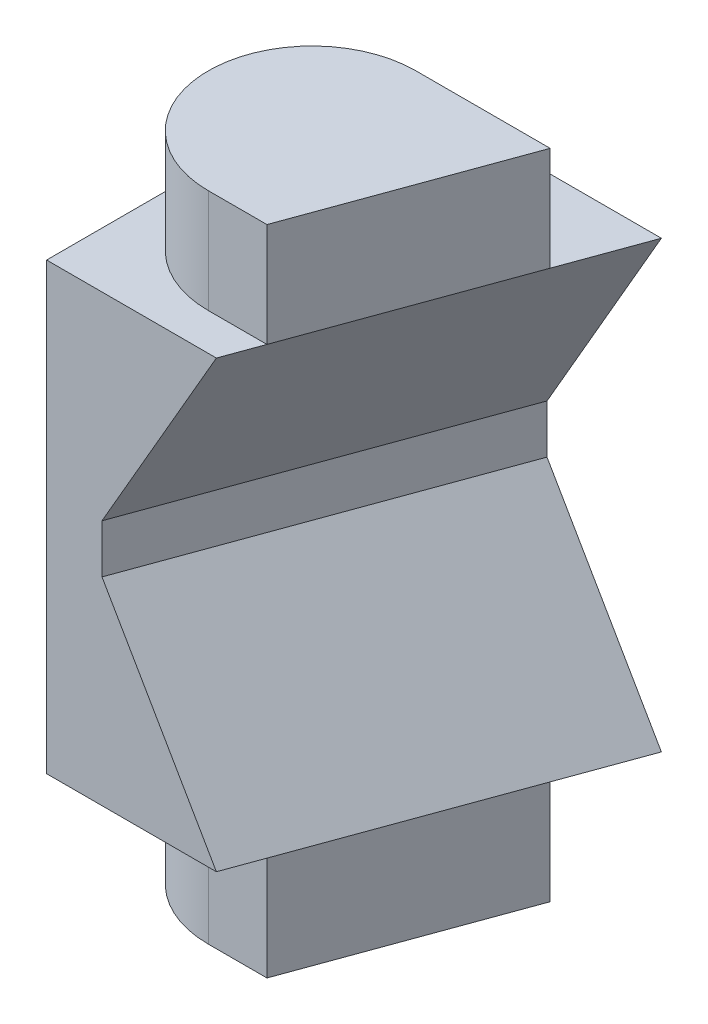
ISO-10303-21;
HEADER;
FILE_DESCRIPTION(('STEP AP214'),'2;1');
FILE_NAME('part.step','',(''),(''),'','','');
FILE_SCHEMA(('AUTOMOTIVE_DESIGN { 1 0 10303 214 1 1 1 1 }'));
ENDSEC;
DATA;
#1=APPLICATION_CONTEXT('core data for automotive mechanical design processes');
#2=APPLICATION_PROTOCOL_DEFINITION('international standard','automotive_design',2000,#1);
#3=PRODUCT_CONTEXT('',#1,'mechanical');
#4=PRODUCT('Part','Part','',(#3));
#5=PRODUCT_RELATED_PRODUCT_CATEGORY('part','',(#4));
#6=PRODUCT_DEFINITION_FORMATION('','',#4);
#7=PRODUCT_DEFINITION_CONTEXT('part definition',#1,'design');
#8=PRODUCT_DEFINITION('design','',#6,#7);
#9=PRODUCT_DEFINITION_SHAPE('','',#8);
#10=(LENGTH_UNIT() NAMED_UNIT(*) SI_UNIT(.MILLI.,.METRE.));
#11=(NAMED_UNIT(*) PLANE_ANGLE_UNIT() SI_UNIT($,.RADIAN.));
#12=(NAMED_UNIT(*) SI_UNIT($,.STERADIAN.) SOLID_ANGLE_UNIT());
#13=UNCERTAINTY_MEASURE_WITH_UNIT(LENGTH_MEASURE(1.E-05),#10,'distance_accuracy_value','');
#14=(GEOMETRIC_REPRESENTATION_CONTEXT(3) GLOBAL_UNCERTAINTY_ASSIGNED_CONTEXT((#13)) GLOBAL_UNIT_ASSIGNED_CONTEXT((#10,
#11,#12)) REPRESENTATION_CONTEXT('',''));
#15=CARTESIAN_POINT('',(0.,0.,0.));
#16=DIRECTION('',(0.,0.,1.));
#17=DIRECTION('',(1.,0.,0.));
#18=AXIS2_PLACEMENT_3D('',#15,#16,#17);
#19=CARTESIAN_POINT('',(-3.20366448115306,7.5,18.7435854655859));
#20=DIRECTION('',(0.,1.,0.));
#21=DIRECTION('',(0.,0.,1.));
#22=AXIS2_PLACEMENT_3D('',#19,#20,#21);
#23=PLANE('',#22);
#24=DIRECTION('',(0.342020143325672,0.,-0.939692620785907));
#25=VECTOR('',#24,1.);
#26=CARTESIAN_POINT('',(19.5018139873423,7.5,-26.8546995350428));
#27=LINE('',#26,#25);
#28=CARTESIAN_POINT('',(5.72383012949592,7.5,11.));
#29=VERTEX_POINT('',#28);
#30=CARTESIAN_POINT('',(6.17879292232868,7.5,9.75));
#31=VERTEX_POINT('',#30);
#32=EDGE_CURVE('E200',#29,#31,#27,.T.);
#33=ORIENTED_EDGE('',*,*,#32,.T.);
#34=DIRECTION('',(-1.,0.,0.));
#35=VECTOR('',#34,1.);
#36=CARTESIAN_POINT('',(4.2,7.5,9.75));
#37=LINE('',#36,#35);
#38=CARTESIAN_POINT('',(4.2,7.5,9.75));
#39=VERTEX_POINT('',#38);
#40=EDGE_CURVE('E136',#31,#39,#37,.T.);
#41=ORIENTED_EDGE('',*,*,#40,.T.);
#42=CARTESIAN_POINT('',(4.2,7.5,6.25));
#43=DIRECTION('',(0.,-1.,0.));
#44=DIRECTION('',(0.,0.,-1.));
#45=AXIS2_PLACEMENT_3D('',#42,#43,#44);
#46=CIRCLE('',#45,3.5);
#47=CARTESIAN_POINT('',(4.2,7.5,2.75));
#48=VERTEX_POINT('',#47);
#49=EDGE_CURVE('E147',#39,#48,#46,.T.);
#50=ORIENTED_EDGE('',*,*,#49,.T.);
#51=DIRECTION('',(1.,0.,0.));
#52=VECTOR('',#51,1.);
#53=CARTESIAN_POINT('',(4.2,7.5,2.75));
#54=LINE('',#53,#52);
#55=CARTESIAN_POINT('',(8.7265845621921,7.5,2.75));
#56=VERTEX_POINT('',#55);
#57=EDGE_CURVE('E150',#48,#56,#54,.T.);
#58=ORIENTED_EDGE('',*,*,#57,.T.);
#59=CARTESIAN_POINT('',(9.7275027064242,7.5,0.));
#60=VERTEX_POINT('',#59);
#61=EDGE_CURVE('E153',#56,#60,#27,.T.);
#62=ORIENTED_EDGE('',*,*,#61,.T.);
#63=DIRECTION('',(1.,0.,0.));
#64=VECTOR('',#63,1.);
#65=CARTESIAN_POINT('',(-2.,7.5,0.));
#66=LINE('',#65,#64);
#67=CARTESIAN_POINT('',(0.,7.5,0.));
#68=VERTEX_POINT('',#67);
#69=EDGE_CURVE('E201',#68,#60,#66,.T.);
#70=ORIENTED_EDGE('',*,*,#69,.F.);
#71=DIRECTION('',(0.,0.,-1.));
#72=VECTOR('',#71,1.);
#73=CARTESIAN_POINT('',(0.,7.5,11.));
#74=LINE('',#73,#72);
#75=CARTESIAN_POINT('',(0.,7.5,11.));
#76=VERTEX_POINT('',#75);
#77=EDGE_CURVE('E297',#76,#68,#74,.T.);
#78=ORIENTED_EDGE('',*,*,#77,.F.);
#79=DIRECTION('',(-1.,0.,0.));
#80=VECTOR('',#79,1.);
#81=CARTESIAN_POINT('',(-3.03469760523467,7.5,11.));
#82=LINE('',#81,#80);
#83=EDGE_CURVE('E9',#29,#76,#82,.T.);
#84=ORIENTED_EDGE('',*,*,#83,.F.);
#85=EDGE_LOOP('',(#33,#41,#50,#58,#62,#70,#78,#84));
#86=FACE_BOUND('',#85,.T.);
#87=ADVANCED_FACE('F14',(#86),#23,.T.);
#88=CARTESIAN_POINT('',(-4.9156779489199,-7.5,16.4707275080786));
#89=DIRECTION('',(0.,1.,0.));
#90=DIRECTION('',(0.,0.,1.));
#91=AXIS2_PLACEMENT_3D('',#88,#89,#90);
#92=PLANE('',#91);
#93=DIRECTION('',(1.,0.,0.));
#94=VECTOR('',#93,1.);
#95=CARTESIAN_POINT('',(4.2,-7.5,2.75));
#96=LINE('',#95,#94);
#97=CARTESIAN_POINT('',(4.2,-7.5,2.75));
#98=VERTEX_POINT('',#97);
#99=CARTESIAN_POINT('',(8.7265845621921,-7.5,2.75));
#100=VERTEX_POINT('',#99);
#101=EDGE_CURVE('E39',#98,#100,#96,.T.);
#102=ORIENTED_EDGE('',*,*,#101,.F.);
#103=CARTESIAN_POINT('',(4.2,-7.5,6.25));
#104=DIRECTION('',(0.,-1.,0.));
#105=DIRECTION('',(0.,0.,-1.));
#106=AXIS2_PLACEMENT_3D('',#103,#104,#105);
#107=CIRCLE('',#106,3.5);
#108=CARTESIAN_POINT('',(4.2,-7.5,9.75));
#109=VERTEX_POINT('',#108);
#110=EDGE_CURVE('E185',#109,#98,#107,.T.);
#111=ORIENTED_EDGE('',*,*,#110,.F.);
#112=DIRECTION('',(-1.,0.,0.));
#113=VECTOR('',#112,1.);
#114=CARTESIAN_POINT('',(4.2,-7.5,9.75));
#115=LINE('',#114,#113);
#116=CARTESIAN_POINT('',(6.17879292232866,-7.5,9.75));
#117=VERTEX_POINT('',#116);
#118=EDGE_CURVE('E187',#117,#109,#115,.T.);
#119=ORIENTED_EDGE('',*,*,#118,.F.);
#120=DIRECTION('',(-0.342020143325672,0.,0.939692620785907));
#121=VECTOR('',#120,1.);
#122=CARTESIAN_POINT('',(19.5018139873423,-7.5,-26.8546995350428));
#123=LINE('',#122,#121);
#124=CARTESIAN_POINT('',(5.72383012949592,-7.5,11.));
#125=VERTEX_POINT('',#124);
#126=EDGE_CURVE('E210',#117,#125,#123,.T.);
#127=ORIENTED_EDGE('',*,*,#126,.T.);
#128=DIRECTION('',(-1.,0.,0.));
#129=VECTOR('',#128,1.);
#130=CARTESIAN_POINT('',(-3.03469760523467,-7.5,11.));
#131=LINE('',#130,#129);
#132=CARTESIAN_POINT('',(0.,-7.5,11.));
#133=VERTEX_POINT('',#132);
#134=EDGE_CURVE('E23',#125,#133,#131,.T.);
#135=ORIENTED_EDGE('',*,*,#134,.T.);
#136=DIRECTION('',(0.,0.,1.));
#137=VECTOR('',#136,1.);
#138=CARTESIAN_POINT('',(0.,-7.5,0.));
#139=LINE('',#138,#137);
#140=CARTESIAN_POINT('',(0.,-7.5,0.));
#141=VERTEX_POINT('',#140);
#142=EDGE_CURVE('E249',#141,#133,#139,.T.);
#143=ORIENTED_EDGE('',*,*,#142,.F.);
#144=DIRECTION('',(1.,0.,0.));
#145=VECTOR('',#144,1.);
#146=CARTESIAN_POINT('',(-2.,-7.5,0.));
#147=LINE('',#146,#145);
#148=CARTESIAN_POINT('',(9.7275027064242,-7.5,0.));
#149=VERTEX_POINT('',#148);
#150=EDGE_CURVE('E213',#141,#149,#147,.T.);
#151=ORIENTED_EDGE('',*,*,#150,.T.);
#152=EDGE_CURVE('E219',#149,#100,#123,.T.);
#153=ORIENTED_EDGE('',*,*,#152,.T.);
#154=EDGE_LOOP('',(#102,#111,#119,#127,#135,#143,#151,#153));
#155=FACE_BOUND('',#154,.T.);
#156=ADVANCED_FACE('F248',(#155),#92,.F.);
#157=CARTESIAN_POINT('',(-2.,10.5,0.));
#158=DIRECTION('',(0.,0.,-1.));
#159=DIRECTION('',(-1.,0.,0.));
#160=AXIS2_PLACEMENT_3D('',#157,#158,#159);
#161=PLANE('',#160);
#162=ORIENTED_EDGE('',*,*,#150,.F.);
#163=DIRECTION('',(0.,-1.,0.));
#164=VECTOR('',#163,1.);
#165=CARTESIAN_POINT('',(0.,7.5,0.));
#166=LINE('',#165,#164);
#167=EDGE_CURVE('E205',#68,#141,#166,.T.);
#168=ORIENTED_EDGE('',*,*,#167,.F.);
#169=ORIENTED_EDGE('',*,*,#69,.T.);
#170=DIRECTION('',(-0.5,-0.866025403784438,0.));
#171=VECTOR('',#170,1.);
#172=CARTESIAN_POINT('',(13.8524784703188,14.6446676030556,0.));
#173=LINE('',#172,#171);
#174=CARTESIAN_POINT('',(5.87080290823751,0.82,0.));
#175=VERTEX_POINT('',#174);
#176=EDGE_CURVE('E230',#60,#175,#173,.T.);
#177=ORIENTED_EDGE('',*,*,#176,.T.);
#178=DIRECTION('',(0.,1.,0.));
#179=VECTOR('',#178,1.);
#180=CARTESIAN_POINT('',(5.87080290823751,-0.82,0.));
#181=LINE('',#180,#179);
#182=CARTESIAN_POINT('',(5.87080290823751,-0.82,0.));
#183=VERTEX_POINT('',#182);
#184=EDGE_CURVE('E236',#183,#175,#181,.T.);
#185=ORIENTED_EDGE('',*,*,#184,.F.);
#186=DIRECTION('',(-0.5,0.866025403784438,0.));
#187=VECTOR('',#186,1.);
#188=CARTESIAN_POINT('',(13.8524784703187,-14.6446676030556,0.));
#189=LINE('',#188,#187);
#190=EDGE_CURVE('E226',#149,#183,#189,.T.);
#191=ORIENTED_EDGE('',*,*,#190,.F.);
#192=EDGE_LOOP('',(#162,#168,#169,#177,#185,#191));
#193=FACE_BOUND('',#192,.T.);
#194=ADVANCED_FACE('F16',(#193),#161,.T.);
#195=CARTESIAN_POINT('',(-3.03469760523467,-15.2330023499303,11.));
#196=DIRECTION('',(0.,0.,1.));
#197=DIRECTION('',(1.,0.,0.));
#198=AXIS2_PLACEMENT_3D('',#195,#196,#197);
#199=PLANE('',#198);
#200=ORIENTED_EDGE('',*,*,#83,.T.);
#201=DIRECTION('',(0.,1.,0.));
#202=VECTOR('',#201,1.);
#203=CARTESIAN_POINT('',(0.,-7.5,11.));
#204=LINE('',#203,#202);
#205=EDGE_CURVE('E296',#133,#76,#204,.T.);
#206=ORIENTED_EDGE('',*,*,#205,.F.);
#207=ORIENTED_EDGE('',*,*,#134,.F.);
#208=DIRECTION('',(0.5,-0.866025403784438,0.));
#209=VECTOR('',#208,1.);
#210=CARTESIAN_POINT('',(10.8497240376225,-16.3783086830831,11.));
#211=LINE('',#210,#209);
#212=CARTESIAN_POINT('',(1.86713033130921,-0.82,11.));
#213=VERTEX_POINT('',#212);
#214=EDGE_CURVE('E234',#213,#125,#211,.T.);
#215=ORIENTED_EDGE('',*,*,#214,.F.);
#216=DIRECTION('',(0.,-1.,0.));
#217=VECTOR('',#216,1.);
#218=CARTESIAN_POINT('',(1.86713033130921,-0.82,11.));
#219=LINE('',#218,#217);
#220=CARTESIAN_POINT('',(1.86713033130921,0.82,11.));
#221=VERTEX_POINT('',#220);
#222=EDGE_CURVE('E241',#221,#213,#219,.T.);
#223=ORIENTED_EDGE('',*,*,#222,.F.);
#224=DIRECTION('',(0.5,0.866025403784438,0.));
#225=VECTOR('',#224,1.);
#226=CARTESIAN_POINT('',(10.8497240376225,16.3783086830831,11.));
#227=LINE('',#226,#225);
#228=EDGE_CURVE('E223',#221,#29,#227,.T.);
#229=ORIENTED_EDGE('',*,*,#228,.T.);
#230=EDGE_LOOP('',(#200,#206,#207,#215,#223,#229));
#231=FACE_BOUND('',#230,.T.);
#232=ADVANCED_FACE('F266',(#231),#199,.T.);
#233=CARTESIAN_POINT('',(21.0312533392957,10.5,-26.2980291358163));
#234=DIRECTION('',(-0.825964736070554,0.476870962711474,-0.300626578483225));
#235=DIRECTION('',(-0.5,-0.866025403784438,0.));
#236=AXIS2_PLACEMENT_3D('',#233,#234,#235);
#237=PLANE('',#236);
#238=ORIENTED_EDGE('',*,*,#32,.F.);
#239=ORIENTED_EDGE('',*,*,#228,.F.);
#240=DIRECTION('',(-0.342020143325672,0.,0.939692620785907));
#241=VECTOR('',#240,1.);
#242=CARTESIAN_POINT('',(15.4425027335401,0.82,-26.2980291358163));
#243=LINE('',#242,#241);
#244=EDGE_CURVE('E231',#175,#221,#243,.T.);
#245=ORIENTED_EDGE('',*,*,#244,.F.);
#246=ORIENTED_EDGE('',*,*,#176,.F.);
#247=ORIENTED_EDGE('',*,*,#61,.F.);
#248=DIRECTION('',(-0.342020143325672,0.,0.939692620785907));
#249=VECTOR('',#248,1.);
#250=CARTESIAN_POINT('',(8.72658456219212,7.5,2.75));
#251=LINE('',#250,#249);
#252=EDGE_CURVE('E31',#56,#31,#251,.T.);
#253=ORIENTED_EDGE('',*,*,#252,.T.);
#254=EDGE_LOOP('',(#238,#239,#245,#246,#247,#253));
#255=FACE_BOUND('',#254,.T.);
#256=ADVANCED_FACE('F264',(#255),#237,.F.);
#257=CARTESIAN_POINT('',(21.0312533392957,-10.5,-26.2980291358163));
#258=DIRECTION('',(0.825964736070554,0.476870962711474,0.300626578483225));
#259=DIRECTION('',(-0.5,0.866025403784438,0.));
#260=AXIS2_PLACEMENT_3D('',#257,#258,#259);
#261=PLANE('',#260);
#262=ORIENTED_EDGE('',*,*,#152,.F.);
#263=ORIENTED_EDGE('',*,*,#190,.T.);
#264=DIRECTION('',(-0.342020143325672,0.,0.939692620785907));
#265=VECTOR('',#264,1.);
#266=CARTESIAN_POINT('',(15.4425027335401,-0.82,-26.2980291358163));
#267=LINE('',#266,#265);
#268=EDGE_CURVE('E227',#183,#213,#267,.T.);
#269=ORIENTED_EDGE('',*,*,#268,.T.);
#270=ORIENTED_EDGE('',*,*,#214,.T.);
#271=ORIENTED_EDGE('',*,*,#126,.F.);
#272=DIRECTION('',(-0.342020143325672,0.,0.939692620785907));
#273=VECTOR('',#272,1.);
#274=CARTESIAN_POINT('',(8.72658456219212,-7.5,2.75));
#275=LINE('',#274,#273);
#276=EDGE_CURVE('E125',#100,#117,#275,.T.);
#277=ORIENTED_EDGE('',*,*,#276,.F.);
#278=EDGE_LOOP('',(#262,#263,#269,#270,#271,#277));
#279=FACE_BOUND('',#278,.T.);
#280=ADVANCED_FACE('F254',(#279),#261,.T.);
#281=CARTESIAN_POINT('',(15.4425027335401,-0.82,-26.2980291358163));
#282=DIRECTION('',(0.939692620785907,0.,0.342020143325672));
#283=DIRECTION('',(0.342020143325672,0.,-0.939692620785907));
#284=AXIS2_PLACEMENT_3D('',#281,#282,#283);
#285=PLANE('',#284);
#286=ORIENTED_EDGE('',*,*,#244,.T.);
#287=ORIENTED_EDGE('',*,*,#222,.T.);
#288=ORIENTED_EDGE('',*,*,#268,.F.);
#289=ORIENTED_EDGE('',*,*,#184,.T.);
#290=EDGE_LOOP('',(#286,#287,#288,#289));
#291=FACE_BOUND('',#290,.T.);
#292=ADVANCED_FACE('F260',(#291),#285,.T.);
#293=CARTESIAN_POINT('',(0.,-7.5,11.));
#294=DIRECTION('',(-1.,0.,0.));
#295=DIRECTION('',(0.,0.,1.));
#296=AXIS2_PLACEMENT_3D('',#293,#294,#295);
#297=PLANE('',#296);
#298=ORIENTED_EDGE('',*,*,#142,.T.);
#299=ORIENTED_EDGE('',*,*,#205,.T.);
#300=ORIENTED_EDGE('',*,*,#77,.T.);
#301=ORIENTED_EDGE('',*,*,#167,.T.);
#302=EDGE_LOOP('',(#298,#299,#300,#301));
#303=FACE_BOUND('',#302,.T.);
#304=ADVANCED_FACE('F301',(#303),#297,.T.);
#305=CARTESIAN_POINT('',(8.72658456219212,-11.,2.75));
#306=DIRECTION('',(-0.939692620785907,0.,-0.342020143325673));
#307=DIRECTION('',(-0.342020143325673,0.,0.939692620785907));
#308=AXIS2_PLACEMENT_3D('',#305,#306,#307);
#309=PLANE('',#308);
#310=ORIENTED_EDGE('',*,*,#276,.T.);
#311=DIRECTION('',(0.,1.,0.));
#312=VECTOR('',#311,1.);
#313=CARTESIAN_POINT('',(6.17879292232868,-11.,9.75));
#314=LINE('',#313,#312);
#315=CARTESIAN_POINT('',(6.17879292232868,-11.,9.75));
#316=VERTEX_POINT('',#315);
#317=EDGE_CURVE('E273',#316,#117,#314,.T.);
#318=ORIENTED_EDGE('',*,*,#317,.F.);
#319=DIRECTION('',(-0.342020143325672,0.,0.939692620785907));
#320=VECTOR('',#319,1.);
#321=CARTESIAN_POINT('',(8.72658456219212,-11.,2.75));
#322=LINE('',#321,#320);
#323=CARTESIAN_POINT('',(8.72658456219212,-11.,2.75));
#324=VERTEX_POINT('',#323);
#325=EDGE_CURVE('E175',#324,#316,#322,.T.);
#326=ORIENTED_EDGE('',*,*,#325,.F.);
#327=DIRECTION('',(0.,1.,0.));
#328=VECTOR('',#327,1.);
#329=CARTESIAN_POINT('',(8.72658456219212,-11.,2.75));
#330=LINE('',#329,#328);
#331=EDGE_CURVE('E184',#324,#100,#330,.T.);
#332=ORIENTED_EDGE('',*,*,#331,.T.);
#333=EDGE_LOOP('',(#310,#318,#326,#332));
#334=FACE_BOUND('',#333,.T.);
#335=ADVANCED_FACE('F281',(#334),#309,.F.);
#336=CARTESIAN_POINT('',(4.2,-11.,9.75));
#337=DIRECTION('',(0.,0.,-1.));
#338=DIRECTION('',(-1.,0.,0.));
#339=AXIS2_PLACEMENT_3D('',#336,#337,#338);
#340=PLANE('',#339);
#341=ORIENTED_EDGE('',*,*,#118,.T.);
#342=DIRECTION('',(0.,1.,0.));
#343=VECTOR('',#342,1.);
#344=CARTESIAN_POINT('',(4.2,-11.,9.75));
#345=LINE('',#344,#343);
#346=CARTESIAN_POINT('',(4.2,-11.,9.75));
#347=VERTEX_POINT('',#346);
#348=EDGE_CURVE('E279',#347,#109,#345,.T.);
#349=ORIENTED_EDGE('',*,*,#348,.F.);
#350=DIRECTION('',(-1.,0.,0.));
#351=VECTOR('',#350,1.);
#352=CARTESIAN_POINT('',(4.2,-11.,9.75));
#353=LINE('',#352,#351);
#354=EDGE_CURVE('E178',#316,#347,#353,.T.);
#355=ORIENTED_EDGE('',*,*,#354,.F.);
#356=ORIENTED_EDGE('',*,*,#317,.T.);
#357=EDGE_LOOP('',(#341,#349,#355,#356));
#358=FACE_BOUND('',#357,.T.);
#359=ADVANCED_FACE('F274',(#358),#340,.F.);
#360=CARTESIAN_POINT('',(4.2,-11.,6.25));
#361=DIRECTION('',(0.,1.,0.));
#362=DIRECTION('',(0.,0.,1.));
#363=AXIS2_PLACEMENT_3D('',#360,#361,#362);
#364=CYLINDRICAL_SURFACE('',#363,3.5);
#365=ORIENTED_EDGE('',*,*,#110,.T.);
#366=DIRECTION('',(0.,1.,0.));
#367=VECTOR('',#366,1.);
#368=CARTESIAN_POINT('',(4.2,-11.,2.75));
#369=LINE('',#368,#367);
#370=CARTESIAN_POINT('',(4.2,-11.,2.75));
#371=VERTEX_POINT('',#370);
#372=EDGE_CURVE('E190',#371,#98,#369,.T.);
#373=ORIENTED_EDGE('',*,*,#372,.F.);
#374=CARTESIAN_POINT('',(4.2,-11.,6.25));
#375=DIRECTION('',(0.,-1.,0.));
#376=DIRECTION('',(0.,0.,-1.));
#377=AXIS2_PLACEMENT_3D('',#374,#375,#376);
#378=CIRCLE('',#377,3.5);
#379=EDGE_CURVE('E180',#347,#371,#378,.T.);
#380=ORIENTED_EDGE('',*,*,#379,.F.);
#381=ORIENTED_EDGE('',*,*,#348,.T.);
#382=EDGE_LOOP('',(#365,#373,#380,#381));
#383=FACE_BOUND('',#382,.T.);
#384=ADVANCED_FACE('F432',(#383),#364,.T.);
#385=CARTESIAN_POINT('',(4.2,-11.,2.75));
#386=DIRECTION('',(0.,0.,1.));
#387=DIRECTION('',(1.,0.,0.));
#388=AXIS2_PLACEMENT_3D('',#385,#386,#387);
#389=PLANE('',#388);
#390=ORIENTED_EDGE('',*,*,#101,.T.);
#391=ORIENTED_EDGE('',*,*,#331,.F.);
#392=DIRECTION('',(1.,0.,0.));
#393=VECTOR('',#392,1.);
#394=CARTESIAN_POINT('',(4.2,-11.,2.75));
#395=LINE('',#394,#393);
#396=EDGE_CURVE('E182',#371,#324,#395,.T.);
#397=ORIENTED_EDGE('',*,*,#396,.F.);
#398=ORIENTED_EDGE('',*,*,#372,.T.);
#399=EDGE_LOOP('',(#390,#391,#397,#398));
#400=FACE_BOUND('',#399,.T.);
#401=ADVANCED_FACE('F289',(#400),#389,.F.);
#402=CARTESIAN_POINT('',(4.2,-11.,6.25));
#403=DIRECTION('',(0.,-1.,0.));
#404=DIRECTION('',(0.,0.,-1.));
#405=AXIS2_PLACEMENT_3D('',#402,#403,#404);
#406=PLANE('',#405);
#407=ORIENTED_EDGE('',*,*,#325,.T.);
#408=ORIENTED_EDGE('',*,*,#354,.T.);
#409=ORIENTED_EDGE('',*,*,#379,.T.);
#410=ORIENTED_EDGE('',*,*,#396,.T.);
#411=EDGE_LOOP('',(#407,#408,#409,#410));
#412=FACE_BOUND('',#411,.T.);
#413=ADVANCED_FACE('F414',(#412),#406,.T.);
#414=CARTESIAN_POINT('',(8.72658456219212,11.,2.75));
#415=DIRECTION('',(0.939692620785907,0.,0.342020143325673));
#416=DIRECTION('',(0.342020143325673,0.,-0.939692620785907));
#417=AXIS2_PLACEMENT_3D('',#414,#415,#416);
#418=PLANE('',#417);
#419=ORIENTED_EDGE('',*,*,#252,.F.);
#420=DIRECTION('',(0.,-1.,0.));
#421=VECTOR('',#420,1.);
#422=CARTESIAN_POINT('',(8.72658456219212,11.,2.75));
#423=LINE('',#422,#421);
#424=CARTESIAN_POINT('',(8.72658456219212,11.,2.75));
#425=VERTEX_POINT('',#424);
#426=EDGE_CURVE('E116',#425,#56,#423,.T.);
#427=ORIENTED_EDGE('',*,*,#426,.F.);
#428=DIRECTION('',(-0.342020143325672,0.,0.939692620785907));
#429=VECTOR('',#428,1.);
#430=CARTESIAN_POINT('',(8.72658456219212,11.,2.75));
#431=LINE('',#430,#429);
#432=CARTESIAN_POINT('',(6.17879292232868,11.,9.75));
#433=VERTEX_POINT('',#432);
#434=EDGE_CURVE('E119',#425,#433,#431,.T.);
#435=ORIENTED_EDGE('',*,*,#434,.T.);
#436=DIRECTION('',(0.,-1.,0.));
#437=VECTOR('',#436,1.);
#438=CARTESIAN_POINT('',(6.17879292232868,11.,9.75));
#439=LINE('',#438,#437);
#440=EDGE_CURVE('E144',#433,#31,#439,.T.);
#441=ORIENTED_EDGE('',*,*,#440,.T.);
#442=EDGE_LOOP('',(#419,#427,#435,#441));
#443=FACE_BOUND('',#442,.T.);
#444=ADVANCED_FACE('F118',(#443),#418,.T.);
#445=CARTESIAN_POINT('',(4.2,11.,2.75));
#446=DIRECTION('',(0.,0.,-1.));
#447=DIRECTION('',(-1.,0.,0.));
#448=AXIS2_PLACEMENT_3D('',#445,#446,#447);
#449=PLANE('',#448);
#450=ORIENTED_EDGE('',*,*,#57,.F.);
#451=DIRECTION('',(0.,-1.,0.));
#452=VECTOR('',#451,1.);
#453=CARTESIAN_POINT('',(4.2,11.,2.75));
#454=LINE('',#453,#452);
#455=CARTESIAN_POINT('',(4.2,11.,2.75));
#456=VERTEX_POINT('',#455);
#457=EDGE_CURVE('E126',#456,#48,#454,.T.);
#458=ORIENTED_EDGE('',*,*,#457,.F.);
#459=DIRECTION('',(1.,0.,0.));
#460=VECTOR('',#459,1.);
#461=CARTESIAN_POINT('',(4.2,11.,2.75));
#462=LINE('',#461,#460);
#463=EDGE_CURVE('E132',#456,#425,#462,.T.);
#464=ORIENTED_EDGE('',*,*,#463,.T.);
#465=ORIENTED_EDGE('',*,*,#426,.T.);
#466=EDGE_LOOP('',(#450,#458,#464,#465));
#467=FACE_BOUND('',#466,.T.);
#468=ADVANCED_FACE('F138',(#467),#449,.T.);
#469=CARTESIAN_POINT('',(4.2,11.,6.25));
#470=DIRECTION('',(0.,-1.,0.));
#471=DIRECTION('',(0.,0.,-1.));
#472=AXIS2_PLACEMENT_3D('',#469,#470,#471);
#473=CYLINDRICAL_SURFACE('',#472,3.5);
#474=ORIENTED_EDGE('',*,*,#49,.F.);
#475=DIRECTION('',(0.,-1.,0.));
#476=VECTOR('',#475,1.);
#477=CARTESIAN_POINT('',(4.2,11.,9.75));
#478=LINE('',#477,#476);
#479=CARTESIAN_POINT('',(4.2,11.,9.75));
#480=VERTEX_POINT('',#479);
#481=EDGE_CURVE('E162',#480,#39,#478,.T.);
#482=ORIENTED_EDGE('',*,*,#481,.F.);
#483=CARTESIAN_POINT('',(4.2,11.,6.25));
#484=DIRECTION('',(0.,-1.,0.));
#485=DIRECTION('',(0.,0.,-1.));
#486=AXIS2_PLACEMENT_3D('',#483,#484,#485);
#487=CIRCLE('',#486,3.5);
#488=EDGE_CURVE('E139',#480,#456,#487,.T.);
#489=ORIENTED_EDGE('',*,*,#488,.T.);
#490=ORIENTED_EDGE('',*,*,#457,.T.);
#491=EDGE_LOOP('',(#474,#482,#489,#490));
#492=FACE_BOUND('',#491,.T.);
#493=ADVANCED_FACE('F172',(#492),#473,.T.);
#494=CARTESIAN_POINT('',(4.2,11.,9.75));
#495=DIRECTION('',(0.,0.,1.));
#496=DIRECTION('',(1.,0.,0.));
#497=AXIS2_PLACEMENT_3D('',#494,#495,#496);
#498=PLANE('',#497);
#499=ORIENTED_EDGE('',*,*,#40,.F.);
#500=ORIENTED_EDGE('',*,*,#440,.F.);
#501=DIRECTION('',(-1.,0.,0.));
#502=VECTOR('',#501,1.);
#503=CARTESIAN_POINT('',(4.2,11.,9.75));
#504=LINE('',#503,#502);
#505=EDGE_CURVE('E135',#433,#480,#504,.T.);
#506=ORIENTED_EDGE('',*,*,#505,.T.);
#507=ORIENTED_EDGE('',*,*,#481,.T.);
#508=EDGE_LOOP('',(#499,#500,#506,#507));
#509=FACE_BOUND('',#508,.T.);
#510=ADVANCED_FACE('F380',(#509),#498,.T.);
#511=CARTESIAN_POINT('',(4.2,11.,6.25));
#512=DIRECTION('',(0.,1.,0.));
#513=DIRECTION('',(0.,0.,-1.));
#514=AXIS2_PLACEMENT_3D('',#511,#512,#513);
#515=PLANE('',#514);
#516=ORIENTED_EDGE('',*,*,#434,.F.);
#517=ORIENTED_EDGE('',*,*,#463,.F.);
#518=ORIENTED_EDGE('',*,*,#488,.F.);
#519=ORIENTED_EDGE('',*,*,#505,.F.);
#520=EDGE_LOOP('',(#516,#517,#518,#519));
#521=FACE_BOUND('',#520,.T.);
#522=ADVANCED_FACE('F130',(#521),#515,.T.);
#523=CLOSED_SHELL('',(#87,#156,#194,#232,#256,#280,#292,#304,#335,#359,#384,#401,#413,#444,#468,
#493,#510,#522));
#524=MANIFOLD_SOLID_BREP('B1',#523);
#525=ADVANCED_BREP_SHAPE_REPRESENTATION('',(#18,#524),#14);
#526=SHAPE_DEFINITION_REPRESENTATION(#9,#525);
ENDSEC;
END-ISO-10303-21;
